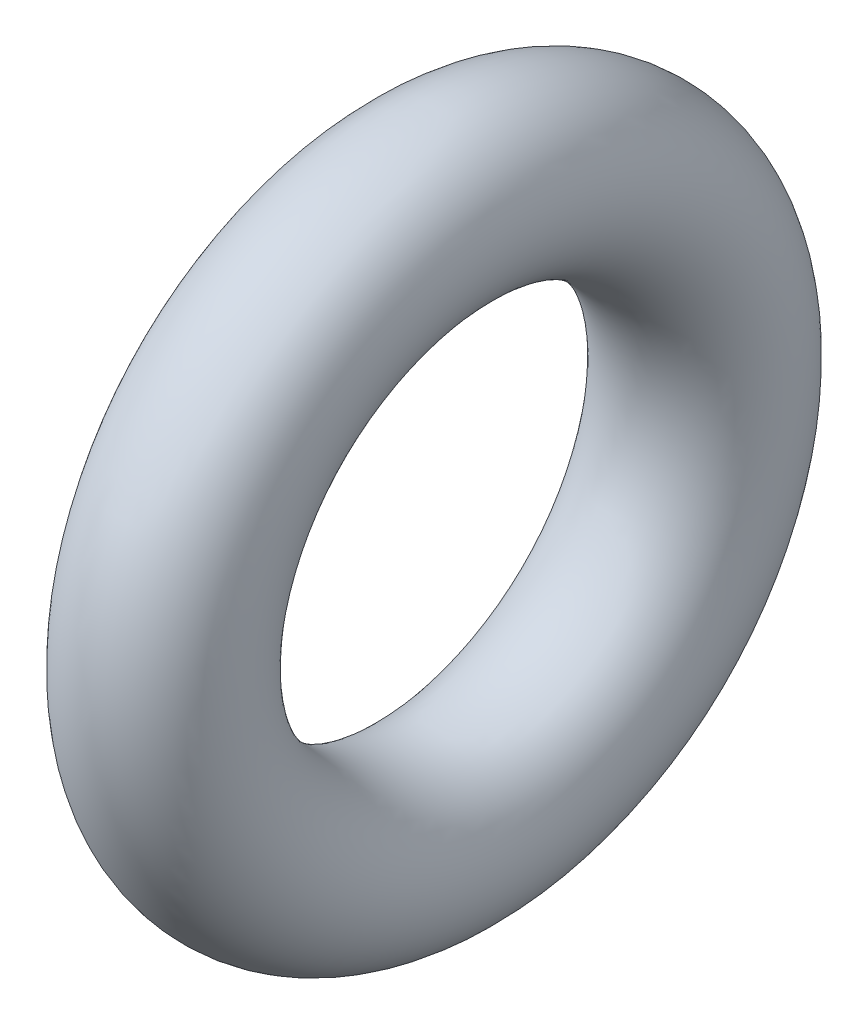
ISO-10303-21;
HEADER;
FILE_DESCRIPTION(('STEP AP214'),'2;1');
FILE_NAME('part.step','',(''),(''),'','','');
FILE_SCHEMA(('AUTOMOTIVE_DESIGN { 1 0 10303 214 1 1 1 1 }'));
ENDSEC;
DATA;
#1=APPLICATION_CONTEXT('core data for automotive mechanical design processes');
#2=APPLICATION_PROTOCOL_DEFINITION('international standard','automotive_design',2000,#1);
#3=PRODUCT_CONTEXT('',#1,'mechanical');
#4=PRODUCT('Part','Part','',(#3));
#5=PRODUCT_RELATED_PRODUCT_CATEGORY('part','',(#4));
#6=PRODUCT_DEFINITION_FORMATION('','',#4);
#7=PRODUCT_DEFINITION_CONTEXT('part definition',#1,'design');
#8=PRODUCT_DEFINITION('design','',#6,#7);
#9=PRODUCT_DEFINITION_SHAPE('','',#8);
#10=(LENGTH_UNIT() NAMED_UNIT(*) SI_UNIT(.MILLI.,.METRE.));
#11=(NAMED_UNIT(*) PLANE_ANGLE_UNIT() SI_UNIT($,.RADIAN.));
#12=(NAMED_UNIT(*) SI_UNIT($,.STERADIAN.) SOLID_ANGLE_UNIT());
#13=UNCERTAINTY_MEASURE_WITH_UNIT(LENGTH_MEASURE(1.E-05),#10,'distance_accuracy_value','');
#14=(GEOMETRIC_REPRESENTATION_CONTEXT(3) GLOBAL_UNCERTAINTY_ASSIGNED_CONTEXT((#13)) GLOBAL_UNIT_ASSIGNED_CONTEXT((#10,
#11,#12)) REPRESENTATION_CONTEXT('',''));
#15=CARTESIAN_POINT('',(0.,0.,0.));
#16=DIRECTION('',(0.,0.,1.));
#17=DIRECTION('',(1.,0.,0.));
#18=AXIS2_PLACEMENT_3D('',#15,#16,#17);
#19=CARTESIAN_POINT('',(5.5,0.,0.));
#20=DIRECTION('',(1.,0.,0.));
#21=DIRECTION('',(0.,-1.,0.));
#22=AXIS2_PLACEMENT_3D('',#19,#20,#21);
#23=TOROIDAL_SURFACE('',#22,9.,2.75);
#24=CARTESIAN_POINT('',(5.5,-11.75,0.));
#25=VERTEX_POINT('',#24);
#26=VERTEX_LOOP('',#25);
#27=FACE_BOUND('',#26,.T.);
#28=ADVANCED_FACE('F12',(#27),#23,.T.);
#29=CLOSED_SHELL('',(#28));
#30=MANIFOLD_SOLID_BREP('B1',#29);
#31=ADVANCED_BREP_SHAPE_REPRESENTATION('',(#18,#30),#14);
#32=SHAPE_DEFINITION_REPRESENTATION(#9,#31);
ENDSEC;
END-ISO-10303-21;
